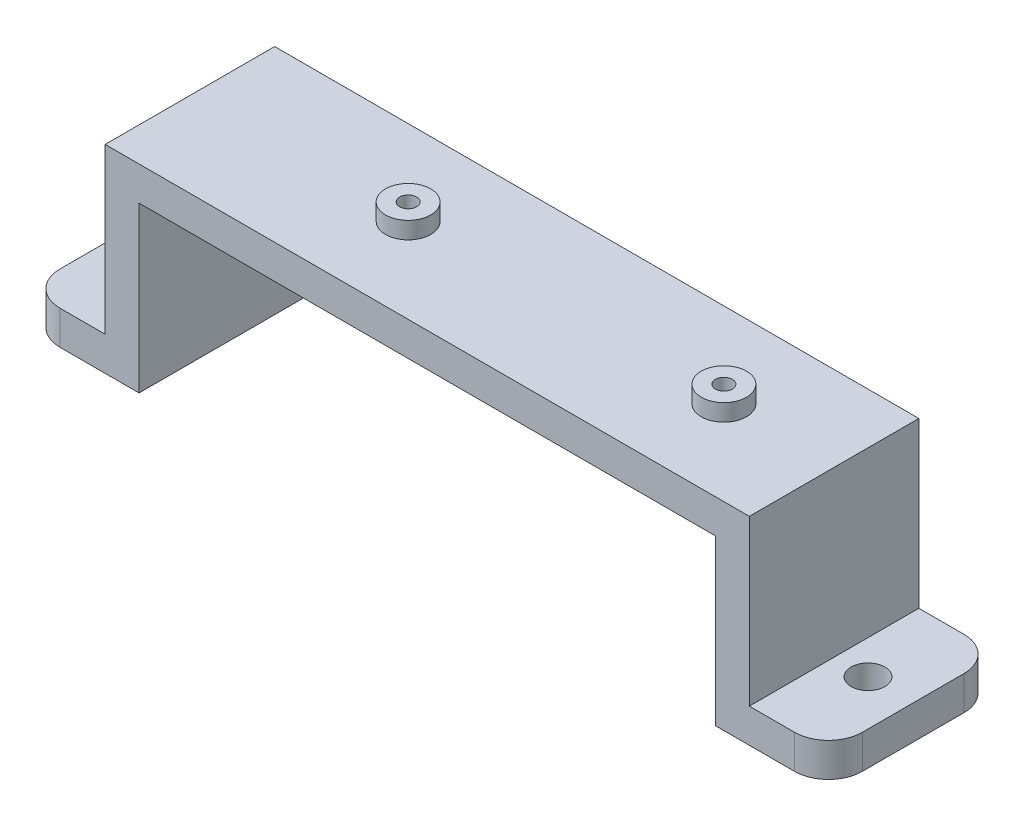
from build123d import *

# Parameters (mm, degrees)
EXTRUSION1_DEPTH        = 15
ESQUISSE2_R             = 0.75
ENL_V_MAT_EXTRU_1_DEPTH = 43.345824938
CONG_1_R                = 3
ESQUISSE3_R             = 1.5
ENL_V_MAT_EXTRU_2_DEPTH = 43.345824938
EXTRUSION2_START        = 1.5
ESQUISSE4_R             = 2
ESQUISSE4_R_2           = 0.75
EXTRUSION2_DEPTH        = 1.5


with BuildPart() as part:
    # Esquisse1 → Extrusion1 (new body)
    with BuildSketch(Plane.XY):
        Polygon((-35.5, 0), (-25.5, 0), (-25.5, 14.547617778), (25.5, 14.547617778), (25.5, 0), (35.5, 0), (35.5, 3), (28.5, 3), (28.5, 17.547617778), (-28.5, 17.547617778), (-28.5, 3), (-35.5, 3), align=None)
    extrude(amount=EXTRUSION1_DEPTH)

    # Esquisse2 → Enl_v. mat.-Extru.1 (cut, through all)
    with BuildSketch(Plane(origin=(0, 17.547617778, 0), x_dir=(-1, 0, 0), z_dir=(0, 1, 0))):
        with Locations(Location((9.19, 7.5, 0), (0, 0, 90))):
            Circle(ESQUISSE2_R)
        with Locations(Location((-18.75, 7.5, 0), (0, 0, 90))):
            Circle(ESQUISSE2_R)
    extrude(amount=-ENL_V_MAT_EXTRU_1_DEPTH, mode=Mode.SUBTRACT)

    # Cong_1
    cong_1_edges = [part.edges().sort_by_distance(p)[0] for p in [
        (35.5, 1.5, 0),
        (-35.5, 1.5, 0),
        (35.5, 1.5, 15),
        (-35.5, 1.5, 15),
    ]]
    fillet(cong_1_edges, radius=CONG_1_R)

    # Esquisse3 → Enl_v. mat.-Extru.2 (cut, through all)
    with BuildSketch(Plane.XZ):
        with Locations((31.5, 7.5)):
            Circle(ESQUISSE3_R)
        with Locations(Location((-31.5, 7.5, 0), (0, 0, 270))):
            Circle(ESQUISSE3_R)
    extrude(amount=-ENL_V_MAT_EXTRU_2_DEPTH, mode=Mode.SUBTRACT)

    # Esquisse4 → Extrusion2 (add)
    # profile 1 of 2: a face of its own
    with BuildSketch(Plane(origin=(0, 17.547617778, 0), x_dir=(-1, 0, 0), z_dir=(0, 1, 0)).offset(EXTRUSION2_START)):
        with Locations(Location((-18.75, 7.5, 0), (0, 0, 270))):
            Circle(ESQUISSE4_R)
        with Locations(Location((-18.75, 7.5, 0), (0, 0, 90))):
            Circle(ESQUISSE4_R_2, mode=Mode.SUBTRACT)
    # profile 2 of 2: a face of its own
    with BuildSketch(Plane(origin=(0, 17.547617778, 0), x_dir=(-1, 0, 0), z_dir=(0, 1, 0)).offset(EXTRUSION2_START)):
        with Locations(Location((9.19, 7.5, 0), (0, 0, 270))):
            Circle(ESQUISSE4_R)
        with Locations(Location((9.19, 7.5, 0), (0, 0, 90))):
            Circle(ESQUISSE4_R_2, mode=Mode.SUBTRACT)
    extrude(amount=-EXTRUSION2_DEPTH)


solid = part.part
